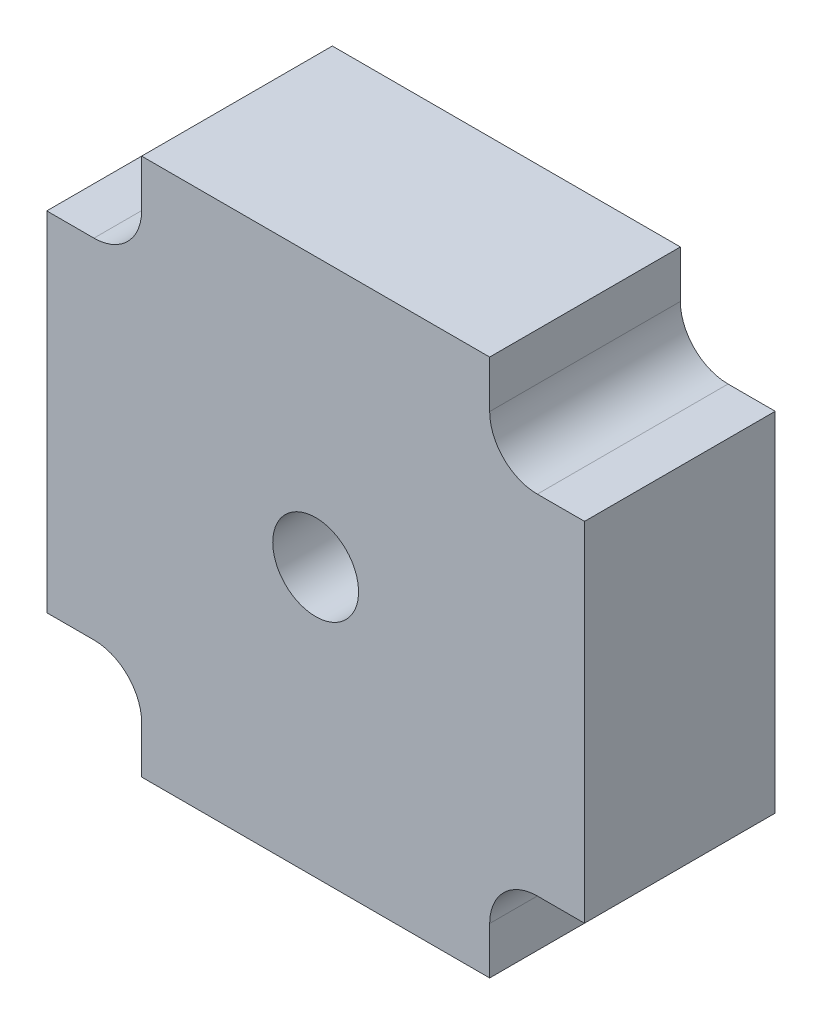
ISO-10303-21;
HEADER;
FILE_DESCRIPTION(('STEP AP214'),'2;1');
FILE_NAME('part.step','',(''),(''),'','','');
FILE_SCHEMA(('AUTOMOTIVE_DESIGN { 1 0 10303 214 1 1 1 1 }'));
ENDSEC;
DATA;
#1=APPLICATION_CONTEXT('core data for automotive mechanical design processes');
#2=APPLICATION_PROTOCOL_DEFINITION('international standard','automotive_design',2000,#1);
#3=PRODUCT_CONTEXT('',#1,'mechanical');
#4=PRODUCT('Part','Part','',(#3));
#5=PRODUCT_RELATED_PRODUCT_CATEGORY('part','',(#4));
#6=PRODUCT_DEFINITION_FORMATION('','',#4);
#7=PRODUCT_DEFINITION_CONTEXT('part definition',#1,'design');
#8=PRODUCT_DEFINITION('design','',#6,#7);
#9=PRODUCT_DEFINITION_SHAPE('','',#8);
#10=(LENGTH_UNIT() NAMED_UNIT(*) SI_UNIT(.MILLI.,.METRE.));
#11=(NAMED_UNIT(*) PLANE_ANGLE_UNIT() SI_UNIT($,.RADIAN.));
#12=(NAMED_UNIT(*) SI_UNIT($,.STERADIAN.) SOLID_ANGLE_UNIT());
#13=UNCERTAINTY_MEASURE_WITH_UNIT(LENGTH_MEASURE(1.E-05),#10,'distance_accuracy_value','');
#14=(GEOMETRIC_REPRESENTATION_CONTEXT(3) GLOBAL_UNCERTAINTY_ASSIGNED_CONTEXT((#13)) GLOBAL_UNIT_ASSIGNED_CONTEXT((#10,
#11,#12)) REPRESENTATION_CONTEXT('',''));
#15=CARTESIAN_POINT('',(0.,0.,0.));
#16=DIRECTION('',(0.,0.,1.));
#17=DIRECTION('',(1.,0.,0.));
#18=AXIS2_PLACEMENT_3D('',#15,#16,#17);
#19=CARTESIAN_POINT('',(-28.2,-18.25,20.));
#20=DIRECTION('',(1.,0.,0.));
#21=DIRECTION('',(0.,0.,-1.));
#22=AXIS2_PLACEMENT_3D('',#19,#20,#21);
#23=PLANE('',#22);
#24=DIRECTION('',(0.,-1.,0.));
#25=VECTOR('',#24,1.);
#26=CARTESIAN_POINT('',(-28.2,-18.25,0.));
#27=LINE('',#26,#25);
#28=CARTESIAN_POINT('',(-28.2,18.25,0.));
#29=VERTEX_POINT('',#28);
#30=CARTESIAN_POINT('',(-28.2,-18.25,0.));
#31=VERTEX_POINT('',#30);
#32=EDGE_CURVE('E170',#29,#31,#27,.T.);
#33=ORIENTED_EDGE('',*,*,#32,.T.);
#34=DIRECTION('',(0.,0.,-1.));
#35=VECTOR('',#34,1.);
#36=CARTESIAN_POINT('',(-28.2,-18.25,20.));
#37=LINE('',#36,#35);
#38=CARTESIAN_POINT('',(-28.2,-18.25,20.));
#39=VERTEX_POINT('',#38);
#40=EDGE_CURVE('E151',#39,#31,#37,.T.);
#41=ORIENTED_EDGE('',*,*,#40,.F.);
#42=DIRECTION('',(0.,-1.,0.));
#43=VECTOR('',#42,1.);
#44=CARTESIAN_POINT('',(-28.2,-18.25,20.));
#45=LINE('',#44,#43);
#46=CARTESIAN_POINT('',(-28.2,18.25,20.));
#47=VERTEX_POINT('',#46);
#48=EDGE_CURVE('E158',#47,#39,#45,.T.);
#49=ORIENTED_EDGE('',*,*,#48,.F.);
#50=DIRECTION('',(0.,0.,-1.));
#51=VECTOR('',#50,1.);
#52=CARTESIAN_POINT('',(-28.2,18.25,20.));
#53=LINE('',#52,#51);
#54=EDGE_CURVE('E217',#47,#29,#53,.T.);
#55=ORIENTED_EDGE('',*,*,#54,.T.);
#56=EDGE_LOOP('',(#33,#41,#49,#55));
#57=FACE_BOUND('',#56,.T.);
#58=ADVANCED_FACE('F33',(#57),#23,.F.);
#59=CARTESIAN_POINT('',(-18.25,-18.25,20.));
#60=DIRECTION('',(0.,1.,0.));
#61=DIRECTION('',(-1.,0.,0.));
#62=AXIS2_PLACEMENT_3D('',#59,#60,#61);
#63=PLANE('',#62);
#64=DIRECTION('',(1.,0.,0.));
#65=VECTOR('',#64,1.);
#66=CARTESIAN_POINT('',(-18.25,-18.25,0.));
#67=LINE('',#66,#65);
#68=CARTESIAN_POINT('',(-23.25,-18.25,0.));
#69=VERTEX_POINT('',#68);
#70=EDGE_CURVE('E291',#31,#69,#67,.T.);
#71=ORIENTED_EDGE('',*,*,#70,.T.);
#72=DIRECTION('',(0.,0.,-1.));
#73=VECTOR('',#72,1.);
#74=CARTESIAN_POINT('',(-23.25,-18.25,20.));
#75=LINE('',#74,#73);
#76=CARTESIAN_POINT('',(-23.25,-18.25,20.));
#77=VERTEX_POINT('',#76);
#78=EDGE_CURVE('E154',#69,#77,#75,.F.);
#79=ORIENTED_EDGE('',*,*,#78,.T.);
#80=DIRECTION('',(1.,0.,0.));
#81=VECTOR('',#80,1.);
#82=CARTESIAN_POINT('',(-18.25,-18.25,20.));
#83=LINE('',#82,#81);
#84=EDGE_CURVE('E146',#39,#77,#83,.T.);
#85=ORIENTED_EDGE('',*,*,#84,.F.);
#86=ORIENTED_EDGE('',*,*,#40,.T.);
#87=EDGE_LOOP('',(#71,#79,#85,#86));
#88=FACE_BOUND('',#87,.T.);
#89=ADVANCED_FACE('F149',(#88),#63,.F.);
#90=CARTESIAN_POINT('',(-18.25,-28.2,20.));
#91=DIRECTION('',(1.,0.,0.));
#92=DIRECTION('',(0.,1.,0.));
#93=AXIS2_PLACEMENT_3D('',#90,#91,#92);
#94=PLANE('',#93);
#95=DIRECTION('',(0.,-1.,0.));
#96=VECTOR('',#95,1.);
#97=CARTESIAN_POINT('',(-18.25,-28.2,20.));
#98=LINE('',#97,#96);
#99=CARTESIAN_POINT('',(-18.25,-23.25,20.));
#100=VERTEX_POINT('',#99);
#101=CARTESIAN_POINT('',(-18.25,-28.2,20.));
#102=VERTEX_POINT('',#101);
#103=EDGE_CURVE('E157',#100,#102,#98,.T.);
#104=ORIENTED_EDGE('',*,*,#103,.F.);
#105=DIRECTION('',(0.,0.,-1.));
#106=VECTOR('',#105,1.);
#107=CARTESIAN_POINT('',(-18.25,-23.25,0.));
#108=LINE('',#107,#106);
#109=CARTESIAN_POINT('',(-18.25,-23.25,0.));
#110=VERTEX_POINT('',#109);
#111=EDGE_CURVE('E183',#100,#110,#108,.T.);
#112=ORIENTED_EDGE('',*,*,#111,.T.);
#113=DIRECTION('',(0.,-1.,0.));
#114=VECTOR('',#113,1.);
#115=CARTESIAN_POINT('',(-18.25,-28.2,0.));
#116=LINE('',#115,#114);
#117=CARTESIAN_POINT('',(-18.25,-28.2,0.));
#118=VERTEX_POINT('',#117);
#119=EDGE_CURVE('E268',#110,#118,#116,.T.);
#120=ORIENTED_EDGE('',*,*,#119,.T.);
#121=DIRECTION('',(0.,0.,-1.));
#122=VECTOR('',#121,1.);
#123=CARTESIAN_POINT('',(-18.25,-28.2,20.));
#124=LINE('',#123,#122);
#125=EDGE_CURVE('E172',#102,#118,#124,.T.);
#126=ORIENTED_EDGE('',*,*,#125,.F.);
#127=EDGE_LOOP('',(#104,#112,#120,#126));
#128=FACE_BOUND('',#127,.T.);
#129=ADVANCED_FACE('F296',(#128),#94,.F.);
#130=CARTESIAN_POINT('',(18.25,-28.2,20.));
#131=DIRECTION('',(0.,1.,0.));
#132=DIRECTION('',(0.,0.,1.));
#133=AXIS2_PLACEMENT_3D('',#130,#131,#132);
#134=PLANE('',#133);
#135=DIRECTION('',(1.,0.,0.));
#136=VECTOR('',#135,1.);
#137=CARTESIAN_POINT('',(18.25,-28.2,0.));
#138=LINE('',#137,#136);
#139=CARTESIAN_POINT('',(18.25,-28.2,0.));
#140=VERTEX_POINT('',#139);
#141=EDGE_CURVE('E262',#118,#140,#138,.T.);
#142=ORIENTED_EDGE('',*,*,#141,.T.);
#143=DIRECTION('',(0.,0.,-1.));
#144=VECTOR('',#143,1.);
#145=CARTESIAN_POINT('',(18.25,-28.2,20.));
#146=LINE('',#145,#144);
#147=CARTESIAN_POINT('',(18.25,-28.2,20.));
#148=VERTEX_POINT('',#147);
#149=EDGE_CURVE('E178',#148,#140,#146,.T.);
#150=ORIENTED_EDGE('',*,*,#149,.F.);
#151=DIRECTION('',(1.,0.,0.));
#152=VECTOR('',#151,1.);
#153=CARTESIAN_POINT('',(18.25,-28.2,20.));
#154=LINE('',#153,#152);
#155=EDGE_CURVE('E299',#102,#148,#154,.T.);
#156=ORIENTED_EDGE('',*,*,#155,.F.);
#157=ORIENTED_EDGE('',*,*,#125,.T.);
#158=EDGE_LOOP('',(#142,#150,#156,#157));
#159=FACE_BOUND('',#158,.T.);
#160=ADVANCED_FACE('F298',(#159),#134,.F.);
#161=CARTESIAN_POINT('',(18.25,-28.2,20.));
#162=DIRECTION('',(-1.,0.,0.));
#163=DIRECTION('',(0.,-1.,0.));
#164=AXIS2_PLACEMENT_3D('',#161,#162,#163);
#165=PLANE('',#164);
#166=DIRECTION('',(0.,1.,0.));
#167=VECTOR('',#166,1.);
#168=CARTESIAN_POINT('',(18.25,-28.2,0.));
#169=LINE('',#168,#167);
#170=CARTESIAN_POINT('',(18.25,-23.25,0.));
#171=VERTEX_POINT('',#170);
#172=EDGE_CURVE('E254',#140,#171,#169,.T.);
#173=ORIENTED_EDGE('',*,*,#172,.T.);
#174=DIRECTION('',(0.,0.,-1.));
#175=VECTOR('',#174,1.);
#176=CARTESIAN_POINT('',(18.25,-23.25,20.));
#177=LINE('',#176,#175);
#178=CARTESIAN_POINT('',(18.25,-23.25,20.));
#179=VERTEX_POINT('',#178);
#180=EDGE_CURVE('E175',#171,#179,#177,.F.);
#181=ORIENTED_EDGE('',*,*,#180,.T.);
#182=DIRECTION('',(0.,1.,0.));
#183=VECTOR('',#182,1.);
#184=CARTESIAN_POINT('',(18.25,-28.2,20.));
#185=LINE('',#184,#183);
#186=EDGE_CURVE('E257',#148,#179,#185,.T.);
#187=ORIENTED_EDGE('',*,*,#186,.F.);
#188=ORIENTED_EDGE('',*,*,#149,.T.);
#189=EDGE_LOOP('',(#173,#181,#187,#188));
#190=FACE_BOUND('',#189,.T.);
#191=ADVANCED_FACE('F253',(#190),#165,.F.);
#192=CARTESIAN_POINT('',(28.2,-18.25,20.));
#193=DIRECTION('',(0.,1.,0.));
#194=DIRECTION('',(-1.,0.,0.));
#195=AXIS2_PLACEMENT_3D('',#192,#193,#194);
#196=PLANE('',#195);
#197=DIRECTION('',(1.,0.,0.));
#198=VECTOR('',#197,1.);
#199=CARTESIAN_POINT('',(28.2,-18.25,20.));
#200=LINE('',#199,#198);
#201=CARTESIAN_POINT('',(23.25,-18.25,20.));
#202=VERTEX_POINT('',#201);
#203=CARTESIAN_POINT('',(28.2,-18.25,20.));
#204=VERTEX_POINT('',#203);
#205=EDGE_CURVE('E301',#202,#204,#200,.T.);
#206=ORIENTED_EDGE('',*,*,#205,.F.);
#207=DIRECTION('',(0.,0.,-1.));
#208=VECTOR('',#207,1.);
#209=CARTESIAN_POINT('',(23.25,-18.25,0.));
#210=LINE('',#209,#208);
#211=CARTESIAN_POINT('',(23.25,-18.25,0.));
#212=VERTEX_POINT('',#211);
#213=EDGE_CURVE('E171',#202,#212,#210,.T.);
#214=ORIENTED_EDGE('',*,*,#213,.T.);
#215=DIRECTION('',(1.,0.,0.));
#216=VECTOR('',#215,1.);
#217=CARTESIAN_POINT('',(28.2,-18.25,0.));
#218=LINE('',#217,#216);
#219=CARTESIAN_POINT('',(28.2,-18.25,0.));
#220=VERTEX_POINT('',#219);
#221=EDGE_CURVE('E264',#212,#220,#218,.T.);
#222=ORIENTED_EDGE('',*,*,#221,.T.);
#223=DIRECTION('',(0.,0.,-1.));
#224=VECTOR('',#223,1.);
#225=CARTESIAN_POINT('',(28.2,-18.25,20.));
#226=LINE('',#225,#224);
#227=EDGE_CURVE('E245',#204,#220,#226,.T.);
#228=ORIENTED_EDGE('',*,*,#227,.F.);
#229=EDGE_LOOP('',(#206,#214,#222,#228));
#230=FACE_BOUND('',#229,.T.);
#231=ADVANCED_FACE('F422',(#230),#196,.F.);
#232=CARTESIAN_POINT('',(28.2,-18.25,20.));
#233=DIRECTION('',(-1.,0.,0.));
#234=DIRECTION('',(0.,0.,1.));
#235=AXIS2_PLACEMENT_3D('',#232,#233,#234);
#236=PLANE('',#235);
#237=DIRECTION('',(0.,1.,0.));
#238=VECTOR('',#237,1.);
#239=CARTESIAN_POINT('',(28.2,-18.25,0.));
#240=LINE('',#239,#238);
#241=CARTESIAN_POINT('',(28.2,18.25,0.));
#242=VERTEX_POINT('',#241);
#243=EDGE_CURVE('E266',#220,#242,#240,.T.);
#244=ORIENTED_EDGE('',*,*,#243,.T.);
#245=DIRECTION('',(0.,0.,-1.));
#246=VECTOR('',#245,1.);
#247=CARTESIAN_POINT('',(28.2,18.25,20.));
#248=LINE('',#247,#246);
#249=CARTESIAN_POINT('',(28.2,18.25,20.));
#250=VERTEX_POINT('',#249);
#251=EDGE_CURVE('E242',#250,#242,#248,.T.);
#252=ORIENTED_EDGE('',*,*,#251,.F.);
#253=DIRECTION('',(0.,1.,0.));
#254=VECTOR('',#253,1.);
#255=CARTESIAN_POINT('',(28.2,-18.25,20.));
#256=LINE('',#255,#254);
#257=EDGE_CURVE('E306',#204,#250,#256,.T.);
#258=ORIENTED_EDGE('',*,*,#257,.F.);
#259=ORIENTED_EDGE('',*,*,#227,.T.);
#260=EDGE_LOOP('',(#244,#252,#258,#259));
#261=FACE_BOUND('',#260,.T.);
#262=ADVANCED_FACE('F414',(#261),#236,.F.);
#263=CARTESIAN_POINT('',(28.2,18.25,20.));
#264=DIRECTION('',(0.,-1.,0.));
#265=DIRECTION('',(1.,0.,0.));
#266=AXIS2_PLACEMENT_3D('',#263,#264,#265);
#267=PLANE('',#266);
#268=DIRECTION('',(-1.,0.,0.));
#269=VECTOR('',#268,1.);
#270=CARTESIAN_POINT('',(28.2,18.25,0.));
#271=LINE('',#270,#269);
#272=CARTESIAN_POINT('',(23.25,18.25,0.));
#273=VERTEX_POINT('',#272);
#274=EDGE_CURVE('E273',#242,#273,#271,.T.);
#275=ORIENTED_EDGE('',*,*,#274,.T.);
#276=DIRECTION('',(0.,0.,-1.));
#277=VECTOR('',#276,1.);
#278=CARTESIAN_POINT('',(23.25,18.25,20.));
#279=LINE('',#278,#277);
#280=CARTESIAN_POINT('',(23.25,18.25,20.));
#281=VERTEX_POINT('',#280);
#282=EDGE_CURVE('E48',#273,#281,#279,.F.);
#283=ORIENTED_EDGE('',*,*,#282,.T.);
#284=DIRECTION('',(-1.,0.,0.));
#285=VECTOR('',#284,1.);
#286=CARTESIAN_POINT('',(28.2,18.25,20.));
#287=LINE('',#286,#285);
#288=EDGE_CURVE('E286',#250,#281,#287,.T.);
#289=ORIENTED_EDGE('',*,*,#288,.F.);
#290=ORIENTED_EDGE('',*,*,#251,.T.);
#291=EDGE_LOOP('',(#275,#283,#289,#290));
#292=FACE_BOUND('',#291,.T.);
#293=ADVANCED_FACE('F406',(#292),#267,.F.);
#294=CARTESIAN_POINT('',(18.25,18.25,20.));
#295=DIRECTION('',(-1.,0.,0.));
#296=DIRECTION('',(0.,-1.,0.));
#297=AXIS2_PLACEMENT_3D('',#294,#295,#296);
#298=PLANE('',#297);
#299=DIRECTION('',(0.,1.,0.));
#300=VECTOR('',#299,1.);
#301=CARTESIAN_POINT('',(18.25,18.25,20.));
#302=LINE('',#301,#300);
#303=CARTESIAN_POINT('',(18.25,23.25,20.));
#304=VERTEX_POINT('',#303);
#305=CARTESIAN_POINT('',(18.25,28.2,20.));
#306=VERTEX_POINT('',#305);
#307=EDGE_CURVE('E283',#304,#306,#302,.T.);
#308=ORIENTED_EDGE('',*,*,#307,.F.);
#309=DIRECTION('',(0.,0.,-1.));
#310=VECTOR('',#309,1.);
#311=CARTESIAN_POINT('',(18.25,23.25,0.));
#312=LINE('',#311,#310);
#313=CARTESIAN_POINT('',(18.25,23.25,0.));
#314=VERTEX_POINT('',#313);
#315=EDGE_CURVE('E192',#304,#314,#312,.T.);
#316=ORIENTED_EDGE('',*,*,#315,.T.);
#317=DIRECTION('',(0.,1.,0.));
#318=VECTOR('',#317,1.);
#319=CARTESIAN_POINT('',(18.25,18.25,0.));
#320=LINE('',#319,#318);
#321=CARTESIAN_POINT('',(18.25,28.2,0.));
#322=VERTEX_POINT('',#321);
#323=EDGE_CURVE('E233',#314,#322,#320,.T.);
#324=ORIENTED_EDGE('',*,*,#323,.T.);
#325=DIRECTION('',(0.,0.,-1.));
#326=VECTOR('',#325,1.);
#327=CARTESIAN_POINT('',(18.25,28.2,20.));
#328=LINE('',#327,#326);
#329=EDGE_CURVE('E239',#306,#322,#328,.T.);
#330=ORIENTED_EDGE('',*,*,#329,.F.);
#331=EDGE_LOOP('',(#308,#316,#324,#330));
#332=FACE_BOUND('',#331,.T.);
#333=ADVANCED_FACE('F277',(#332),#298,.F.);
#334=CARTESIAN_POINT('',(18.25,28.2,20.));
#335=DIRECTION('',(0.,-1.,0.));
#336=DIRECTION('',(0.,0.,-1.));
#337=AXIS2_PLACEMENT_3D('',#334,#335,#336);
#338=PLANE('',#337);
#339=DIRECTION('',(-1.,0.,0.));
#340=VECTOR('',#339,1.);
#341=CARTESIAN_POINT('',(18.25,28.2,0.));
#342=LINE('',#341,#340);
#343=CARTESIAN_POINT('',(-18.25,28.2,0.));
#344=VERTEX_POINT('',#343);
#345=EDGE_CURVE('E230',#322,#344,#342,.T.);
#346=ORIENTED_EDGE('',*,*,#345,.T.);
#347=DIRECTION('',(0.,0.,-1.));
#348=VECTOR('',#347,1.);
#349=CARTESIAN_POINT('',(-18.25,28.2,20.));
#350=LINE('',#349,#348);
#351=CARTESIAN_POINT('',(-18.25,28.2,20.));
#352=VERTEX_POINT('',#351);
#353=EDGE_CURVE('E229',#352,#344,#350,.T.);
#354=ORIENTED_EDGE('',*,*,#353,.F.);
#355=DIRECTION('',(-1.,0.,0.));
#356=VECTOR('',#355,1.);
#357=CARTESIAN_POINT('',(18.25,28.2,20.));
#358=LINE('',#357,#356);
#359=EDGE_CURVE('E282',#306,#352,#358,.T.);
#360=ORIENTED_EDGE('',*,*,#359,.F.);
#361=ORIENTED_EDGE('',*,*,#329,.T.);
#362=EDGE_LOOP('',(#346,#354,#360,#361));
#363=FACE_BOUND('',#362,.T.);
#364=ADVANCED_FACE('F281',(#363),#338,.F.);
#365=CARTESIAN_POINT('',(-18.25,18.25,20.));
#366=DIRECTION('',(1.,0.,0.));
#367=DIRECTION('',(0.,1.,0.));
#368=AXIS2_PLACEMENT_3D('',#365,#366,#367);
#369=PLANE('',#368);
#370=DIRECTION('',(0.,-1.,0.));
#371=VECTOR('',#370,1.);
#372=CARTESIAN_POINT('',(-18.25,18.25,0.));
#373=LINE('',#372,#371);
#374=CARTESIAN_POINT('',(-18.25,23.25,0.));
#375=VERTEX_POINT('',#374);
#376=EDGE_CURVE('E224',#344,#375,#373,.T.);
#377=ORIENTED_EDGE('',*,*,#376,.T.);
#378=DIRECTION('',(0.,0.,-1.));
#379=VECTOR('',#378,1.);
#380=CARTESIAN_POINT('',(-18.25,23.25,20.));
#381=LINE('',#380,#379);
#382=CARTESIAN_POINT('',(-18.25,23.25,20.));
#383=VERTEX_POINT('',#382);
#384=EDGE_CURVE('E190',#375,#383,#381,.F.);
#385=ORIENTED_EDGE('',*,*,#384,.T.);
#386=DIRECTION('',(0.,-1.,0.));
#387=VECTOR('',#386,1.);
#388=CARTESIAN_POINT('',(-18.25,18.25,20.));
#389=LINE('',#388,#387);
#390=EDGE_CURVE('E210',#352,#383,#389,.T.);
#391=ORIENTED_EDGE('',*,*,#390,.F.);
#392=ORIENTED_EDGE('',*,*,#353,.T.);
#393=EDGE_LOOP('',(#377,#385,#391,#392));
#394=FACE_BOUND('',#393,.T.);
#395=ADVANCED_FACE('F227',(#394),#369,.F.);
#396=CARTESIAN_POINT('',(-18.25,18.25,20.));
#397=DIRECTION('',(0.,-1.,0.));
#398=DIRECTION('',(1.,0.,0.));
#399=AXIS2_PLACEMENT_3D('',#396,#397,#398);
#400=PLANE('',#399);
#401=DIRECTION('',(-1.,0.,0.));
#402=VECTOR('',#401,1.);
#403=CARTESIAN_POINT('',(-18.25,18.25,20.));
#404=LINE('',#403,#402);
#405=CARTESIAN_POINT('',(-23.25,18.25,20.));
#406=VERTEX_POINT('',#405);
#407=EDGE_CURVE('E163',#406,#47,#404,.T.);
#408=ORIENTED_EDGE('',*,*,#407,.F.);
#409=DIRECTION('',(0.,0.,-1.));
#410=VECTOR('',#409,1.);
#411=CARTESIAN_POINT('',(-23.25,18.25,0.));
#412=LINE('',#411,#410);
#413=CARTESIAN_POINT('',(-23.25,18.25,0.));
#414=VERTEX_POINT('',#413);
#415=EDGE_CURVE('E187',#406,#414,#412,.T.);
#416=ORIENTED_EDGE('',*,*,#415,.T.);
#417=DIRECTION('',(-1.,0.,0.));
#418=VECTOR('',#417,1.);
#419=CARTESIAN_POINT('',(-18.25,18.25,0.));
#420=LINE('',#419,#418);
#421=EDGE_CURVE('E167',#414,#29,#420,.T.);
#422=ORIENTED_EDGE('',*,*,#421,.T.);
#423=ORIENTED_EDGE('',*,*,#54,.F.);
#424=EDGE_LOOP('',(#408,#416,#422,#423));
#425=FACE_BOUND('',#424,.T.);
#426=ADVANCED_FACE('F215',(#425),#400,.F.);
#427=CARTESIAN_POINT('',(0.,0.,20.));
#428=DIRECTION('',(0.,0.,1.));
#429=DIRECTION('',(1.,0.,0.));
#430=AXIS2_PLACEMENT_3D('',#427,#428,#429);
#431=PLANE('',#430);
#432=CARTESIAN_POINT('',(0.,0.,20.));
#433=DIRECTION('',(0.,0.,-1.));
#434=DIRECTION('',(-1.,0.,0.));
#435=AXIS2_PLACEMENT_3D('',#432,#433,#434);
#436=CIRCLE('',#435,4.5);
#437=CARTESIAN_POINT('',(-4.5,0.,20.));
#438=VERTEX_POINT('',#437);
#439=EDGE_CURVE('E292',#438,#438,#436,.T.);
#440=ORIENTED_EDGE('',*,*,#439,.T.);
#441=EDGE_LOOP('',(#440));
#442=FACE_BOUND('',#441,.T.);
#443=ORIENTED_EDGE('',*,*,#48,.T.);
#444=ORIENTED_EDGE('',*,*,#84,.T.);
#445=CARTESIAN_POINT('',(-23.25,-23.25,20.));
#446=DIRECTION('',(0.,0.,1.));
#447=DIRECTION('',(1.,0.,0.));
#448=AXIS2_PLACEMENT_3D('',#445,#446,#447);
#449=CIRCLE('',#448,5.);
#450=EDGE_CURVE('E202',#77,#100,#449,.F.);
#451=ORIENTED_EDGE('',*,*,#450,.T.);
#452=ORIENTED_EDGE('',*,*,#103,.T.);
#453=ORIENTED_EDGE('',*,*,#155,.T.);
#454=ORIENTED_EDGE('',*,*,#186,.T.);
#455=CARTESIAN_POINT('',(23.25,-23.25,20.));
#456=DIRECTION('',(0.,0.,1.));
#457=DIRECTION('',(1.,0.,0.));
#458=AXIS2_PLACEMENT_3D('',#455,#456,#457);
#459=CIRCLE('',#458,5.);
#460=EDGE_CURVE('E198',#179,#202,#459,.F.);
#461=ORIENTED_EDGE('',*,*,#460,.T.);
#462=ORIENTED_EDGE('',*,*,#205,.T.);
#463=ORIENTED_EDGE('',*,*,#257,.T.);
#464=ORIENTED_EDGE('',*,*,#288,.T.);
#465=CARTESIAN_POINT('',(23.25,23.25,20.));
#466=DIRECTION('',(0.,0.,1.));
#467=DIRECTION('',(1.,0.,0.));
#468=AXIS2_PLACEMENT_3D('',#465,#466,#467);
#469=CIRCLE('',#468,5.);
#470=EDGE_CURVE('E11',#281,#304,#469,.F.);
#471=ORIENTED_EDGE('',*,*,#470,.T.);
#472=ORIENTED_EDGE('',*,*,#307,.T.);
#473=ORIENTED_EDGE('',*,*,#359,.T.);
#474=ORIENTED_EDGE('',*,*,#390,.T.);
#475=CARTESIAN_POINT('',(-23.25,23.25,20.));
#476=DIRECTION('',(0.,0.,1.));
#477=DIRECTION('',(1.,0.,0.));
#478=AXIS2_PLACEMENT_3D('',#475,#476,#477);
#479=CIRCLE('',#478,5.);
#480=EDGE_CURVE('E206',#383,#406,#479,.F.);
#481=ORIENTED_EDGE('',*,*,#480,.T.);
#482=ORIENTED_EDGE('',*,*,#407,.T.);
#483=EDGE_LOOP('',(#443,#444,#451,#452,#453,#454,#461,#462,#463,#464,#471,#472,#473,#474,#481,#482));
#484=FACE_BOUND('',#483,.T.);
#485=ADVANCED_FACE('F161',(#442,#484),#431,.T.);
#486=CARTESIAN_POINT('',(0.,0.,0.));
#487=DIRECTION('',(0.,0.,1.));
#488=DIRECTION('',(1.,0.,0.));
#489=AXIS2_PLACEMENT_3D('',#486,#487,#488);
#490=PLANE('',#489);
#491=CARTESIAN_POINT('',(0.,0.,0.));
#492=DIRECTION('',(0.,0.,-1.));
#493=DIRECTION('',(-1.,0.,0.));
#494=AXIS2_PLACEMENT_3D('',#491,#492,#493);
#495=CIRCLE('',#494,4.5);
#496=CARTESIAN_POINT('',(-4.5,0.,0.));
#497=VERTEX_POINT('',#496);
#498=EDGE_CURVE('E481',#497,#497,#495,.T.);
#499=ORIENTED_EDGE('',*,*,#498,.F.);
#500=EDGE_LOOP('',(#499));
#501=FACE_BOUND('',#500,.T.);
#502=ORIENTED_EDGE('',*,*,#32,.F.);
#503=ORIENTED_EDGE('',*,*,#421,.F.);
#504=CARTESIAN_POINT('',(-23.25,23.25,0.));
#505=DIRECTION('',(0.,0.,1.));
#506=DIRECTION('',(1.,0.,0.));
#507=AXIS2_PLACEMENT_3D('',#504,#505,#506);
#508=CIRCLE('',#507,5.);
#509=EDGE_CURVE('E204',#414,#375,#508,.T.);
#510=ORIENTED_EDGE('',*,*,#509,.T.);
#511=ORIENTED_EDGE('',*,*,#376,.F.);
#512=ORIENTED_EDGE('',*,*,#345,.F.);
#513=ORIENTED_EDGE('',*,*,#323,.F.);
#514=CARTESIAN_POINT('',(23.25,23.25,0.));
#515=DIRECTION('',(0.,0.,1.));
#516=DIRECTION('',(1.,0.,0.));
#517=AXIS2_PLACEMENT_3D('',#514,#515,#516);
#518=CIRCLE('',#517,5.);
#519=EDGE_CURVE('E41',#314,#273,#518,.T.);
#520=ORIENTED_EDGE('',*,*,#519,.T.);
#521=ORIENTED_EDGE('',*,*,#274,.F.);
#522=ORIENTED_EDGE('',*,*,#243,.F.);
#523=ORIENTED_EDGE('',*,*,#221,.F.);
#524=CARTESIAN_POINT('',(23.25,-23.25,0.));
#525=DIRECTION('',(0.,0.,1.));
#526=DIRECTION('',(1.,0.,0.));
#527=AXIS2_PLACEMENT_3D('',#524,#525,#526);
#528=CIRCLE('',#527,5.);
#529=EDGE_CURVE('E196',#212,#171,#528,.T.);
#530=ORIENTED_EDGE('',*,*,#529,.T.);
#531=ORIENTED_EDGE('',*,*,#172,.F.);
#532=ORIENTED_EDGE('',*,*,#141,.F.);
#533=ORIENTED_EDGE('',*,*,#119,.F.);
#534=CARTESIAN_POINT('',(-23.25,-23.25,0.));
#535=DIRECTION('',(0.,0.,1.));
#536=DIRECTION('',(1.,0.,0.));
#537=AXIS2_PLACEMENT_3D('',#534,#535,#536);
#538=CIRCLE('',#537,5.);
#539=EDGE_CURVE('E200',#110,#69,#538,.T.);
#540=ORIENTED_EDGE('',*,*,#539,.T.);
#541=ORIENTED_EDGE('',*,*,#70,.F.);
#542=EDGE_LOOP('',(#502,#503,#510,#511,#512,#513,#520,#521,#522,#523,#530,#531,#532,#533,#540,#541));
#543=FACE_BOUND('',#542,.T.);
#544=ADVANCED_FACE('F222',(#501,#543),#490,.F.);
#545=CARTESIAN_POINT('',(0.,0.,20.));
#546=DIRECTION('',(0.,0.,-1.));
#547=DIRECTION('',(-1.,0.,0.));
#548=AXIS2_PLACEMENT_3D('',#545,#546,#547);
#549=CYLINDRICAL_SURFACE('',#548,4.5);
#550=ORIENTED_EDGE('',*,*,#439,.F.);
#551=EDGE_LOOP('',(#550));
#552=FACE_BOUND('',#551,.T.);
#553=ORIENTED_EDGE('',*,*,#498,.T.);
#554=EDGE_LOOP('',(#553));
#555=FACE_BOUND('',#554,.T.);
#556=ADVANCED_FACE('F327',(#552,#555),#549,.F.);
#557=CARTESIAN_POINT('',(23.25,-23.25,20.));
#558=DIRECTION('',(0.,0.,1.));
#559=DIRECTION('',(1.,0.,0.));
#560=AXIS2_PLACEMENT_3D('',#557,#558,#559);
#561=CYLINDRICAL_SURFACE('',#560,5.);
#562=ORIENTED_EDGE('',*,*,#460,.F.);
#563=ORIENTED_EDGE('',*,*,#180,.F.);
#564=ORIENTED_EDGE('',*,*,#529,.F.);
#565=ORIENTED_EDGE('',*,*,#213,.F.);
#566=EDGE_LOOP('',(#562,#563,#564,#565));
#567=FACE_BOUND('',#566,.T.);
#568=ADVANCED_FACE('F324',(#567),#561,.F.);
#569=CARTESIAN_POINT('',(-23.25,-23.25,20.));
#570=DIRECTION('',(0.,0.,1.));
#571=DIRECTION('',(1.,0.,0.));
#572=AXIS2_PLACEMENT_3D('',#569,#570,#571);
#573=CYLINDRICAL_SURFACE('',#572,5.);
#574=ORIENTED_EDGE('',*,*,#450,.F.);
#575=ORIENTED_EDGE('',*,*,#78,.F.);
#576=ORIENTED_EDGE('',*,*,#539,.F.);
#577=ORIENTED_EDGE('',*,*,#111,.F.);
#578=EDGE_LOOP('',(#574,#575,#576,#577));
#579=FACE_BOUND('',#578,.T.);
#580=ADVANCED_FACE('F315',(#579),#573,.F.);
#581=CARTESIAN_POINT('',(-23.25,23.25,20.));
#582=DIRECTION('',(0.,0.,1.));
#583=DIRECTION('',(1.,0.,0.));
#584=AXIS2_PLACEMENT_3D('',#581,#582,#583);
#585=CYLINDRICAL_SURFACE('',#584,5.);
#586=ORIENTED_EDGE('',*,*,#480,.F.);
#587=ORIENTED_EDGE('',*,*,#384,.F.);
#588=ORIENTED_EDGE('',*,*,#509,.F.);
#589=ORIENTED_EDGE('',*,*,#415,.F.);
#590=EDGE_LOOP('',(#586,#587,#588,#589));
#591=FACE_BOUND('',#590,.T.);
#592=ADVANCED_FACE('F219',(#591),#585,.F.);
#593=CARTESIAN_POINT('',(23.25,23.25,20.));
#594=DIRECTION('',(0.,0.,1.));
#595=DIRECTION('',(1.,0.,0.));
#596=AXIS2_PLACEMENT_3D('',#593,#594,#595);
#597=CYLINDRICAL_SURFACE('',#596,5.);
#598=ORIENTED_EDGE('',*,*,#470,.F.);
#599=ORIENTED_EDGE('',*,*,#282,.F.);
#600=ORIENTED_EDGE('',*,*,#519,.F.);
#601=ORIENTED_EDGE('',*,*,#315,.F.);
#602=EDGE_LOOP('',(#598,#599,#600,#601));
#603=FACE_BOUND('',#602,.T.);
#604=ADVANCED_FACE('F35',(#603),#597,.F.);
#605=CLOSED_SHELL('',(#58,#89,#129,#160,#191,#231,#262,#293,#333,#364,#395,#426,#485,#544,#556,
#568,#580,#592,#604));
#606=MANIFOLD_SOLID_BREP('B2',#605);
#607=ADVANCED_BREP_SHAPE_REPRESENTATION('',(#18,#606),#14);
#608=SHAPE_DEFINITION_REPRESENTATION(#9,#607);
ENDSEC;
END-ISO-10303-21;
